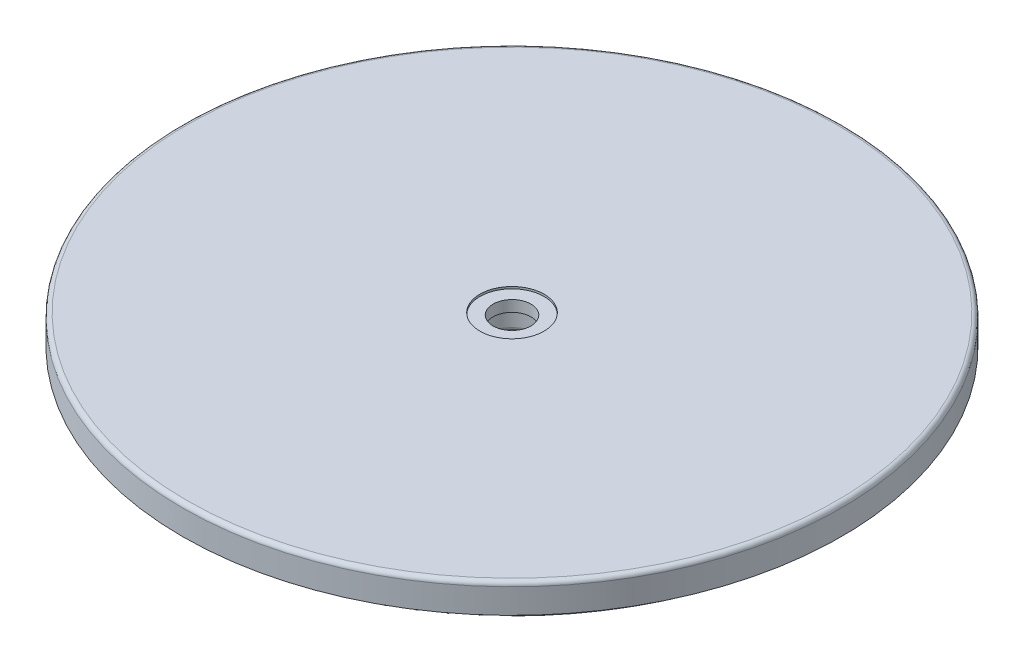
ISO-10303-21;
HEADER;
FILE_DESCRIPTION(('STEP AP214'),'2;1');
FILE_NAME('part.step','',(''),(''),'','','');
FILE_SCHEMA(('AUTOMOTIVE_DESIGN { 1 0 10303 214 1 1 1 1 }'));
ENDSEC;
DATA;
#1=APPLICATION_CONTEXT('core data for automotive mechanical design processes');
#2=APPLICATION_PROTOCOL_DEFINITION('international standard','automotive_design',2000,#1);
#3=PRODUCT_CONTEXT('',#1,'mechanical');
#4=PRODUCT('Part','Part','',(#3));
#5=PRODUCT_RELATED_PRODUCT_CATEGORY('part','',(#4));
#6=PRODUCT_DEFINITION_FORMATION('','',#4);
#7=PRODUCT_DEFINITION_CONTEXT('part definition',#1,'design');
#8=PRODUCT_DEFINITION('design','',#6,#7);
#9=PRODUCT_DEFINITION_SHAPE('','',#8);
#10=(LENGTH_UNIT() NAMED_UNIT(*) SI_UNIT(.MILLI.,.METRE.));
#11=(NAMED_UNIT(*) PLANE_ANGLE_UNIT() SI_UNIT($,.RADIAN.));
#12=(NAMED_UNIT(*) SI_UNIT($,.STERADIAN.) SOLID_ANGLE_UNIT());
#13=UNCERTAINTY_MEASURE_WITH_UNIT(LENGTH_MEASURE(1.E-05),#10,'distance_accuracy_value','');
#14=(GEOMETRIC_REPRESENTATION_CONTEXT(3) GLOBAL_UNCERTAINTY_ASSIGNED_CONTEXT((#13)) GLOBAL_UNIT_ASSIGNED_CONTEXT((#10,
#11,#12)) REPRESENTATION_CONTEXT('',''));
#15=CARTESIAN_POINT('',(0.,0.,0.));
#16=DIRECTION('',(0.,0.,1.));
#17=DIRECTION('',(1.,0.,0.));
#18=AXIS2_PLACEMENT_3D('',#15,#16,#17);
#19=CARTESIAN_POINT('',(-20.,0.,0.));
#20=DIRECTION('',(0.,-1.,0.));
#21=DIRECTION('',(0.,0.,-1.));
#22=AXIS2_PLACEMENT_3D('',#19,#20,#21);
#23=PLANE('',#22);
#24=CARTESIAN_POINT('',(0.,0.,0.));
#25=DIRECTION('',(0.,-1.,0.));
#26=DIRECTION('',(0.,0.,-1.));
#27=AXIS2_PLACEMENT_3D('',#24,#25,#26);
#28=CIRCLE('',#27,11.5);
#29=CARTESIAN_POINT('',(0.,0.,-11.5));
#30=VERTEX_POINT('',#29);
#31=EDGE_CURVE('P0_E25',#30,#30,#28,.F.);
#32=ORIENTED_EDGE('',*,*,#31,.T.);
#33=EDGE_LOOP('',(#32));
#34=FACE_BOUND('',#33,.T.);
#35=CARTESIAN_POINT('',(0.,0.,0.));
#36=DIRECTION('',(0.,-1.,0.));
#37=DIRECTION('',(0.,0.,-1.));
#38=AXIS2_PLACEMENT_3D('',#35,#36,#37);
#39=CIRCLE('',#38,18.5);
#40=CARTESIAN_POINT('',(0.,0.,-18.5));
#41=VERTEX_POINT('',#40);
#42=EDGE_CURVE('P0_E29',#41,#41,#39,.T.);
#43=ORIENTED_EDGE('',*,*,#42,.T.);
#44=EDGE_LOOP('',(#43));
#45=FACE_BOUND('',#44,.T.);
#46=ADVANCED_FACE('P0_F14',(#34,#45),#23,.T.);
#47=CARTESIAN_POINT('',(0.,33.9182926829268,0.));
#48=DIRECTION('',(0.,1.,0.));
#49=DIRECTION('',(0.,0.,1.));
#50=AXIS2_PLACEMENT_3D('',#47,#48,#49);
#51=CYLINDRICAL_SURFACE('',#50,20.);
#52=CARTESIAN_POINT('',(0.,1.5,0.));
#53=DIRECTION('',(0.,-1.,0.));
#54=DIRECTION('',(0.,0.,-1.));
#55=AXIS2_PLACEMENT_3D('',#52,#53,#54);
#56=CIRCLE('',#55,20.);
#57=CARTESIAN_POINT('',(0.,1.5,-20.));
#58=VERTEX_POINT('',#57);
#59=EDGE_CURVE('P0_E9',#58,#58,#56,.F.);
#60=ORIENTED_EDGE('',*,*,#59,.T.);
#61=EDGE_LOOP('',(#60));
#62=FACE_BOUND('',#61,.T.);
#63=CARTESIAN_POINT('',(0.,4.5,0.));
#64=DIRECTION('',(0.,1.,0.));
#65=DIRECTION('',(0.,0.,1.));
#66=AXIS2_PLACEMENT_3D('',#63,#64,#65);
#67=CIRCLE('',#66,20.);
#68=CARTESIAN_POINT('',(0.,4.5,20.));
#69=VERTEX_POINT('',#68);
#70=EDGE_CURVE('P0_E46',#69,#69,#67,.T.);
#71=ORIENTED_EDGE('',*,*,#70,.F.);
#72=EDGE_LOOP('',(#71));
#73=FACE_BOUND('',#72,.T.);
#74=ADVANCED_FACE('P0_F78',(#62,#73),#51,.T.);
#75=CARTESIAN_POINT('',(-67.5,4.5,0.));
#76=DIRECTION('',(0.,-1.,0.));
#77=DIRECTION('',(0.,0.,-1.));
#78=AXIS2_PLACEMENT_3D('',#75,#76,#77);
#79=PLANE('',#78);
#80=ORIENTED_EDGE('',*,*,#70,.T.);
#81=EDGE_LOOP('',(#80));
#82=FACE_BOUND('',#81,.T.);
#83=CARTESIAN_POINT('',(0.,4.5,0.));
#84=DIRECTION('',(0.,1.,0.));
#85=DIRECTION('',(0.,0.,1.));
#86=AXIS2_PLACEMENT_3D('',#83,#84,#85);
#87=CIRCLE('',#86,67.5);
#88=CARTESIAN_POINT('',(0.,4.5,67.5));
#89=VERTEX_POINT('',#88);
#90=EDGE_CURVE('P0_E49',#89,#89,#87,.T.);
#91=ORIENTED_EDGE('',*,*,#90,.F.);
#92=EDGE_LOOP('',(#91));
#93=FACE_BOUND('',#92,.T.);
#94=ADVANCED_FACE('P0_F85',(#82,#93),#79,.T.);
#95=CARTESIAN_POINT('',(0.,33.9182926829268,0.));
#96=DIRECTION('',(0.,1.,0.));
#97=DIRECTION('',(0.,0.,1.));
#98=AXIS2_PLACEMENT_3D('',#95,#96,#97);
#99=CYLINDRICAL_SURFACE('',#98,67.5);
#100=CARTESIAN_POINT('',(0.,1.5,0.));
#101=DIRECTION('',(0.,-1.,0.));
#102=DIRECTION('',(0.,0.,-1.));
#103=AXIS2_PLACEMENT_3D('',#100,#101,#102);
#104=CIRCLE('',#103,67.5);
#105=CARTESIAN_POINT('',(0.,1.5,-67.5));
#106=VERTEX_POINT('',#105);
#107=EDGE_CURVE('P0_E34',#106,#106,#104,.T.);
#108=ORIENTED_EDGE('',*,*,#107,.T.);
#109=EDGE_LOOP('',(#108));
#110=FACE_BOUND('',#109,.T.);
#111=ORIENTED_EDGE('',*,*,#90,.T.);
#112=EDGE_LOOP('',(#111));
#113=FACE_BOUND('',#112,.T.);
#114=ADVANCED_FACE('P0_F123',(#110,#113),#99,.F.);
#115=CARTESIAN_POINT('',(-110.,0.,0.));
#116=DIRECTION('',(0.,-1.,0.));
#117=DIRECTION('',(0.,0.,-1.));
#118=AXIS2_PLACEMENT_3D('',#115,#116,#117);
#119=PLANE('',#118);
#120=CARTESIAN_POINT('',(0.,0.,0.));
#121=DIRECTION('',(0.,-1.,0.));
#122=DIRECTION('',(0.,0.,-1.));
#123=AXIS2_PLACEMENT_3D('',#120,#121,#122);
#124=CIRCLE('',#123,108.5);
#125=CARTESIAN_POINT('',(0.,0.,-108.5));
#126=VERTEX_POINT('',#125);
#127=EDGE_CURVE('P0_E37',#126,#126,#124,.T.);
#128=ORIENTED_EDGE('',*,*,#127,.T.);
#129=EDGE_LOOP('',(#128));
#130=FACE_BOUND('',#129,.T.);
#131=CARTESIAN_POINT('',(0.,0.,0.));
#132=DIRECTION('',(0.,-1.,0.));
#133=DIRECTION('',(0.,0.,-1.));
#134=AXIS2_PLACEMENT_3D('',#131,#132,#133);
#135=CIRCLE('',#134,69.);
#136=CARTESIAN_POINT('',(0.,0.,-69.));
#137=VERTEX_POINT('',#136);
#138=EDGE_CURVE('P0_E40',#137,#137,#135,.F.);
#139=ORIENTED_EDGE('',*,*,#138,.T.);
#140=EDGE_LOOP('',(#139));
#141=FACE_BOUND('',#140,.T.);
#142=ADVANCED_FACE('P0_F74',(#130,#141),#119,.T.);
#143=CARTESIAN_POINT('',(0.,33.9182926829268,0.));
#144=DIRECTION('',(0.,1.,0.));
#145=DIRECTION('',(0.,0.,1.));
#146=AXIS2_PLACEMENT_3D('',#143,#144,#145);
#147=CYLINDRICAL_SURFACE('',#146,110.);
#148=CARTESIAN_POINT('',(0.,1.5,0.));
#149=DIRECTION('',(0.,-1.,0.));
#150=DIRECTION('',(0.,0.,-1.));
#151=AXIS2_PLACEMENT_3D('',#148,#149,#150);
#152=CIRCLE('',#151,110.);
#153=CARTESIAN_POINT('',(0.,1.5,-110.));
#154=VERTEX_POINT('',#153);
#155=EDGE_CURVE('P0_E43',#154,#154,#152,.F.);
#156=ORIENTED_EDGE('',*,*,#155,.T.);
#157=EDGE_LOOP('',(#156));
#158=FACE_BOUND('',#157,.T.);
#159=CARTESIAN_POINT('',(0.,6.5,0.));
#160=DIRECTION('',(0.,1.,0.));
#161=DIRECTION('',(0.,0.,1.));
#162=AXIS2_PLACEMENT_3D('',#159,#160,#161);
#163=CIRCLE('',#162,110.);
#164=CARTESIAN_POINT('',(0.,6.5,110.));
#165=VERTEX_POINT('',#164);
#166=EDGE_CURVE('P0_E52',#165,#165,#163,.T.);
#167=ORIENTED_EDGE('',*,*,#166,.F.);
#168=EDGE_LOOP('',(#167));
#169=FACE_BOUND('',#168,.T.);
#170=ADVANCED_FACE('P0_F63',(#158,#169),#147,.T.);
#171=CARTESIAN_POINT('',(-110.,6.5,0.));
#172=DIRECTION('',(0.,1.,0.));
#173=DIRECTION('',(0.,0.,1.));
#174=AXIS2_PLACEMENT_3D('',#171,#172,#173);
#175=PLANE('',#174);
#176=ORIENTED_EDGE('',*,*,#166,.T.);
#177=EDGE_LOOP('',(#176));
#178=FACE_BOUND('',#177,.T.);
#179=CARTESIAN_POINT('',(0.,6.5,0.));
#180=DIRECTION('',(0.,1.,0.));
#181=DIRECTION('',(0.,0.,1.));
#182=AXIS2_PLACEMENT_3D('',#179,#180,#181);
#183=CIRCLE('',#182,9.99999999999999);
#184=CARTESIAN_POINT('',(0.,6.5,9.99999999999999));
#185=VERTEX_POINT('',#184);
#186=EDGE_CURVE('P0_E55',#185,#185,#183,.T.);
#187=ORIENTED_EDGE('',*,*,#186,.F.);
#188=EDGE_LOOP('',(#187));
#189=FACE_BOUND('',#188,.T.);
#190=ADVANCED_FACE('P0_F61',(#178,#189),#175,.T.);
#191=CARTESIAN_POINT('',(0.,33.9182926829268,0.));
#192=DIRECTION('',(0.,1.,0.));
#193=DIRECTION('',(0.,0.,1.));
#194=AXIS2_PLACEMENT_3D('',#191,#192,#193);
#195=CYLINDRICAL_SURFACE('',#194,9.99999999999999);
#196=CARTESIAN_POINT('',(0.,1.5,0.));
#197=DIRECTION('',(0.,-1.,0.));
#198=DIRECTION('',(0.,0.,-1.));
#199=AXIS2_PLACEMENT_3D('',#196,#197,#198);
#200=CIRCLE('',#199,9.99999999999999);
#201=CARTESIAN_POINT('',(0.,1.5,-9.99999999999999));
#202=VERTEX_POINT('',#201);
#203=EDGE_CURVE('P0_E21',#202,#202,#200,.T.);
#204=ORIENTED_EDGE('',*,*,#203,.T.);
#205=EDGE_LOOP('',(#204));
#206=FACE_BOUND('',#205,.T.);
#207=ORIENTED_EDGE('',*,*,#186,.T.);
#208=EDGE_LOOP('',(#207));
#209=FACE_BOUND('',#208,.T.);
#210=ADVANCED_FACE('P0_F59',(#206,#209),#195,.F.);
#211=CARTESIAN_POINT('',(0.,1.5,0.));
#212=DIRECTION('',(0.,-1.,0.));
#213=DIRECTION('',(0.,0.,-1.));
#214=AXIS2_PLACEMENT_3D('',#211,#212,#213);
#215=TOROIDAL_SURFACE('',#214,108.5,1.5);
#216=ORIENTED_EDGE('',*,*,#127,.F.);
#217=EDGE_LOOP('',(#216));
#218=FACE_BOUND('',#217,.T.);
#219=ORIENTED_EDGE('',*,*,#155,.F.);
#220=EDGE_LOOP('',(#219));
#221=FACE_BOUND('',#220,.T.);
#222=ADVANCED_FACE('P0_F72',(#218,#221),#215,.T.);
#223=CARTESIAN_POINT('',(0.,1.5,0.));
#224=DIRECTION('',(0.,-1.,0.));
#225=DIRECTION('',(0.,0.,-1.));
#226=AXIS2_PLACEMENT_3D('',#223,#224,#225);
#227=TOROIDAL_SURFACE('',#226,69.,1.5);
#228=ORIENTED_EDGE('',*,*,#107,.F.);
#229=EDGE_LOOP('',(#228));
#230=FACE_BOUND('',#229,.T.);
#231=ORIENTED_EDGE('',*,*,#138,.F.);
#232=EDGE_LOOP('',(#231));
#233=FACE_BOUND('',#232,.T.);
#234=ADVANCED_FACE('P0_F92',(#230,#233),#227,.T.);
#235=CARTESIAN_POINT('',(0.,1.5,0.));
#236=DIRECTION('',(0.,-1.,0.));
#237=DIRECTION('',(0.,0.,-1.));
#238=AXIS2_PLACEMENT_3D('',#235,#236,#237);
#239=TOROIDAL_SURFACE('',#238,11.5,1.5);
#240=ORIENTED_EDGE('',*,*,#203,.F.);
#241=EDGE_LOOP('',(#240));
#242=FACE_BOUND('',#241,.T.);
#243=ORIENTED_EDGE('',*,*,#31,.F.);
#244=EDGE_LOOP('',(#243));
#245=FACE_BOUND('',#244,.T.);
#246=ADVANCED_FACE('P0_F95',(#242,#245),#239,.T.);
#247=CARTESIAN_POINT('',(0.,1.5,0.));
#248=DIRECTION('',(0.,-1.,0.));
#249=DIRECTION('',(0.,0.,-1.));
#250=AXIS2_PLACEMENT_3D('',#247,#248,#249);
#251=TOROIDAL_SURFACE('',#250,18.5,1.5);
#252=ORIENTED_EDGE('',*,*,#42,.F.);
#253=EDGE_LOOP('',(#252));
#254=FACE_BOUND('',#253,.T.);
#255=ORIENTED_EDGE('',*,*,#59,.F.);
#256=EDGE_LOOP('',(#255));
#257=FACE_BOUND('',#256,.T.);
#258=ADVANCED_FACE('P0_F16',(#254,#257),#251,.T.);
#259=CLOSED_SHELL('',(#46,#74,#94,#114,#142,#170,#190,#210,#222,#234,#246,#258));
#260=MANIFOLD_SOLID_BREP('P0_B1',#259);
#261=CARTESIAN_POINT('',(-10.,8.49999999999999,0.));
#262=DIRECTION('',(0.,1.,0.));
#263=DIRECTION('',(0.,0.,1.));
#264=AXIS2_PLACEMENT_3D('',#261,#262,#263);
#265=PLANE('',#264);
#266=CARTESIAN_POINT('',(0.,8.49999999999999,0.));
#267=DIRECTION('',(0.,-1.,0.));
#268=DIRECTION('',(0.,0.,-1.));
#269=AXIS2_PLACEMENT_3D('',#266,#267,#268);
#270=CIRCLE('',#269,6.5);
#271=CARTESIAN_POINT('',(0.,8.49999999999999,-6.5));
#272=VERTEX_POINT('',#271);
#273=EDGE_CURVE('P1_E25',#272,#272,#270,.T.);
#274=ORIENTED_EDGE('',*,*,#273,.F.);
#275=EDGE_LOOP('',(#274));
#276=FACE_BOUND('',#275,.T.);
#277=CARTESIAN_POINT('',(0.,8.49999999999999,0.));
#278=DIRECTION('',(0.,-1.,0.));
#279=DIRECTION('',(0.,0.,-1.));
#280=AXIS2_PLACEMENT_3D('',#277,#278,#279);
#281=CIRCLE('',#280,10.);
#282=CARTESIAN_POINT('',(0.,8.49999999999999,-10.));
#283=VERTEX_POINT('',#282);
#284=EDGE_CURVE('P1_E52',#283,#283,#281,.T.);
#285=ORIENTED_EDGE('',*,*,#284,.T.);
#286=EDGE_LOOP('',(#285));
#287=FACE_BOUND('',#286,.T.);
#288=ADVANCED_FACE('P1_F14',(#276,#287),#265,.F.);
#289=CARTESIAN_POINT('',(0.,0.194528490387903,0.));
#290=DIRECTION('',(0.,-1.,0.));
#291=DIRECTION('',(0.,0.,-1.));
#292=AXIS2_PLACEMENT_3D('',#289,#290,#291);
#293=CYLINDRICAL_SURFACE('',#292,6.5);
#294=CARTESIAN_POINT('',(0.,12.3,0.));
#295=DIRECTION('',(0.,-1.,0.));
#296=DIRECTION('',(0.,0.,-1.));
#297=AXIS2_PLACEMENT_3D('',#294,#295,#296);
#298=CIRCLE('',#297,6.5);
#299=CARTESIAN_POINT('',(0.,12.3,-6.5));
#300=VERTEX_POINT('',#299);
#301=EDGE_CURVE('P1_E29',#300,#300,#298,.T.);
#302=ORIENTED_EDGE('',*,*,#301,.F.);
#303=EDGE_LOOP('',(#302));
#304=FACE_BOUND('',#303,.T.);
#305=ORIENTED_EDGE('',*,*,#273,.T.);
#306=EDGE_LOOP('',(#305));
#307=FACE_BOUND('',#306,.T.);
#308=ADVANCED_FACE('P1_F92',(#304,#307),#293,.F.);
#309=CARTESIAN_POINT('',(-6.5,12.3,0.));
#310=DIRECTION('',(0.,-1.,0.));
#311=DIRECTION('',(0.,0.,-1.));
#312=AXIS2_PLACEMENT_3D('',#309,#310,#311);
#313=PLANE('',#312);
#314=CARTESIAN_POINT('',(0.,12.3,0.));
#315=DIRECTION('',(0.,-1.,0.));
#316=DIRECTION('',(0.,0.,-1.));
#317=AXIS2_PLACEMENT_3D('',#314,#315,#316);
#318=CIRCLE('',#317,11.);
#319=CARTESIAN_POINT('',(0.,12.3,-11.));
#320=VERTEX_POINT('',#319);
#321=EDGE_CURVE('P1_E34',#320,#320,#318,.T.);
#322=ORIENTED_EDGE('',*,*,#321,.F.);
#323=EDGE_LOOP('',(#322));
#324=FACE_BOUND('',#323,.T.);
#325=ORIENTED_EDGE('',*,*,#301,.T.);
#326=EDGE_LOOP('',(#325));
#327=FACE_BOUND('',#326,.T.);
#328=ADVANCED_FACE('P1_F97',(#324,#327),#313,.F.);
#329=CARTESIAN_POINT('',(0.,0.194528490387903,0.));
#330=DIRECTION('',(0.,-1.,0.));
#331=DIRECTION('',(0.,0.,-1.));
#332=AXIS2_PLACEMENT_3D('',#329,#330,#331);
#333=CYLINDRICAL_SURFACE('',#332,11.);
#334=CARTESIAN_POINT('',(0.,13.,0.));
#335=DIRECTION('',(0.,-1.,0.));
#336=DIRECTION('',(0.,0.,-1.));
#337=AXIS2_PLACEMENT_3D('',#334,#335,#336);
#338=CIRCLE('',#337,11.);
#339=CARTESIAN_POINT('',(0.,13.,-11.));
#340=VERTEX_POINT('',#339);
#341=EDGE_CURVE('P1_E37',#340,#340,#338,.T.);
#342=ORIENTED_EDGE('',*,*,#341,.F.);
#343=EDGE_LOOP('',(#342));
#344=FACE_BOUND('',#343,.T.);
#345=ORIENTED_EDGE('',*,*,#321,.T.);
#346=EDGE_LOOP('',(#345));
#347=FACE_BOUND('',#346,.T.);
#348=ADVANCED_FACE('P1_F89',(#344,#347),#333,.F.);
#349=CARTESIAN_POINT('',(-113.,13.,0.));
#350=DIRECTION('',(0.,-1.,0.));
#351=DIRECTION('',(0.,0.,-1.));
#352=AXIS2_PLACEMENT_3D('',#349,#350,#351);
#353=PLANE('',#352);
#354=CARTESIAN_POINT('',(0.,13.,0.));
#355=DIRECTION('',(0.,-1.,0.));
#356=DIRECTION('',(0.,0.,-1.));
#357=AXIS2_PLACEMENT_3D('',#354,#355,#356);
#358=CIRCLE('',#357,111.5);
#359=CARTESIAN_POINT('',(0.,13.,-111.5));
#360=VERTEX_POINT('',#359);
#361=EDGE_CURVE('P1_E9',#360,#360,#358,.F.);
#362=ORIENTED_EDGE('',*,*,#361,.T.);
#363=EDGE_LOOP('',(#362));
#364=FACE_BOUND('',#363,.T.);
#365=ORIENTED_EDGE('',*,*,#341,.T.);
#366=EDGE_LOOP('',(#365));
#367=FACE_BOUND('',#366,.T.);
#368=ADVANCED_FACE('P1_F83',(#364,#367),#353,.F.);
#369=CARTESIAN_POINT('',(0.,0.194528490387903,0.));
#370=DIRECTION('',(0.,-1.,0.));
#371=DIRECTION('',(0.,0.,-1.));
#372=AXIS2_PLACEMENT_3D('',#369,#370,#371);
#373=CYLINDRICAL_SURFACE('',#372,113.);
#374=CARTESIAN_POINT('',(0.,11.5,0.));
#375=DIRECTION('',(0.,-1.,0.));
#376=DIRECTION('',(0.,0.,-1.));
#377=AXIS2_PLACEMENT_3D('',#374,#375,#376);
#378=CIRCLE('',#377,113.);
#379=CARTESIAN_POINT('',(0.,11.5,-113.));
#380=VERTEX_POINT('',#379);
#381=EDGE_CURVE('P1_E21',#380,#380,#378,.T.);
#382=ORIENTED_EDGE('',*,*,#381,.T.);
#383=EDGE_LOOP('',(#382));
#384=FACE_BOUND('',#383,.T.);
#385=CARTESIAN_POINT('',(0.,2.99999999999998,0.));
#386=DIRECTION('',(0.,-1.,0.));
#387=DIRECTION('',(0.,0.,-1.));
#388=AXIS2_PLACEMENT_3D('',#385,#386,#387);
#389=CIRCLE('',#388,113.);
#390=CARTESIAN_POINT('',(0.,2.99999999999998,-113.));
#391=VERTEX_POINT('',#390);
#392=EDGE_CURVE('P1_E40',#391,#391,#389,.T.);
#393=ORIENTED_EDGE('',*,*,#392,.F.);
#394=EDGE_LOOP('',(#393));
#395=FACE_BOUND('',#394,.T.);
#396=ADVANCED_FACE('P1_F78',(#384,#395),#373,.T.);
#397=CARTESIAN_POINT('',(-110.5,2.99999999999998,0.));
#398=DIRECTION('',(0.,1.,0.));
#399=DIRECTION('',(0.,0.,1.));
#400=AXIS2_PLACEMENT_3D('',#397,#398,#399);
#401=PLANE('',#400);
#402=CARTESIAN_POINT('',(0.,2.99999999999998,0.));
#403=DIRECTION('',(0.,-1.,0.));
#404=DIRECTION('',(0.,0.,-1.));
#405=AXIS2_PLACEMENT_3D('',#402,#403,#404);
#406=CIRCLE('',#405,110.5);
#407=CARTESIAN_POINT('',(0.,2.99999999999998,-110.5));
#408=VERTEX_POINT('',#407);
#409=EDGE_CURVE('P1_E43',#408,#408,#406,.T.);
#410=ORIENTED_EDGE('',*,*,#409,.F.);
#411=EDGE_LOOP('',(#410));
#412=FACE_BOUND('',#411,.T.);
#413=ORIENTED_EDGE('',*,*,#392,.T.);
#414=EDGE_LOOP('',(#413));
#415=FACE_BOUND('',#414,.T.);
#416=ADVANCED_FACE('P1_F72',(#412,#415),#401,.F.);
#417=CARTESIAN_POINT('',(0.,0.194528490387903,0.));
#418=DIRECTION('',(0.,-1.,0.));
#419=DIRECTION('',(0.,0.,-1.));
#420=AXIS2_PLACEMENT_3D('',#417,#418,#419);
#421=CYLINDRICAL_SURFACE('',#420,110.5);
#422=CARTESIAN_POINT('',(0.,6.49999999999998,0.));
#423=DIRECTION('',(0.,-1.,0.));
#424=DIRECTION('',(0.,0.,-1.));
#425=AXIS2_PLACEMENT_3D('',#422,#423,#424);
#426=CIRCLE('',#425,110.5);
#427=CARTESIAN_POINT('',(0.,6.49999999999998,-110.5));
#428=VERTEX_POINT('',#427);
#429=EDGE_CURVE('P1_E46',#428,#428,#426,.T.);
#430=ORIENTED_EDGE('',*,*,#429,.F.);
#431=EDGE_LOOP('',(#430));
#432=FACE_BOUND('',#431,.T.);
#433=ORIENTED_EDGE('',*,*,#409,.T.);
#434=EDGE_LOOP('',(#433));
#435=FACE_BOUND('',#434,.T.);
#436=ADVANCED_FACE('P1_F66',(#432,#435),#421,.F.);
#437=CARTESIAN_POINT('',(-110.5,6.5,0.));
#438=DIRECTION('',(0.,1.,0.));
#439=DIRECTION('',(0.,0.,1.));
#440=AXIS2_PLACEMENT_3D('',#437,#438,#439);
#441=PLANE('',#440);
#442=CARTESIAN_POINT('',(0.,6.50000000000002,0.));
#443=DIRECTION('',(0.,-1.,0.));
#444=DIRECTION('',(0.,0.,-1.));
#445=AXIS2_PLACEMENT_3D('',#442,#443,#444);
#446=CIRCLE('',#445,9.99999999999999);
#447=CARTESIAN_POINT('',(0.,6.50000000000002,-9.99999999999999));
#448=VERTEX_POINT('',#447);
#449=EDGE_CURVE('P1_E49',#448,#448,#446,.T.);
#450=ORIENTED_EDGE('',*,*,#449,.F.);
#451=EDGE_LOOP('',(#450));
#452=FACE_BOUND('',#451,.T.);
#453=ORIENTED_EDGE('',*,*,#429,.T.);
#454=EDGE_LOOP('',(#453));
#455=FACE_BOUND('',#454,.T.);
#456=ADVANCED_FACE('P1_F60',(#452,#455),#441,.F.);
#457=CARTESIAN_POINT('',(0.,0.194528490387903,0.));
#458=DIRECTION('',(0.,-1.,0.));
#459=DIRECTION('',(0.,0.,-1.));
#460=AXIS2_PLACEMENT_3D('',#457,#458,#459);
#461=CYLINDRICAL_SURFACE('',#460,10.);
#462=ORIENTED_EDGE('',*,*,#284,.F.);
#463=EDGE_LOOP('',(#462));
#464=FACE_BOUND('',#463,.T.);
#465=ORIENTED_EDGE('',*,*,#449,.T.);
#466=EDGE_LOOP('',(#465));
#467=FACE_BOUND('',#466,.T.);
#468=ADVANCED_FACE('P1_F57',(#464,#467),#461,.F.);
#469=CARTESIAN_POINT('',(0.,11.5,0.));
#470=DIRECTION('',(0.,-1.,0.));
#471=DIRECTION('',(0.,0.,-1.));
#472=AXIS2_PLACEMENT_3D('',#469,#470,#471);
#473=TOROIDAL_SURFACE('',#472,111.5,1.5);
#474=ORIENTED_EDGE('',*,*,#361,.F.);
#475=EDGE_LOOP('',(#474));
#476=FACE_BOUND('',#475,.T.);
#477=ORIENTED_EDGE('',*,*,#381,.F.);
#478=EDGE_LOOP('',(#477));
#479=FACE_BOUND('',#478,.T.);
#480=ADVANCED_FACE('P1_F16',(#476,#479),#473,.T.);
#481=CLOSED_SHELL('',(#288,#308,#328,#348,#368,#396,#416,#436,#456,#468,#480));
#482=MANIFOLD_SOLID_BREP('P1_B1',#481);
#483=ADVANCED_BREP_SHAPE_REPRESENTATION('',(#18,#260,#482),#14);
#484=SHAPE_DEFINITION_REPRESENTATION(#9,#483);
ENDSEC;
END-ISO-10303-21;
